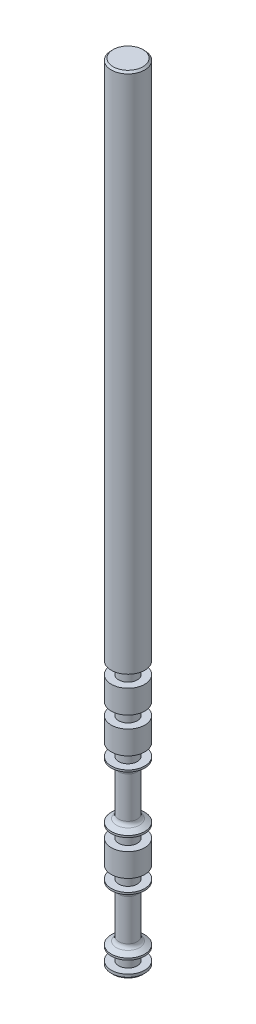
ISO-10303-21;
HEADER;
FILE_DESCRIPTION(('STEP AP214'),'2;1');
FILE_NAME('part.step','',(''),(''),'','','');
FILE_SCHEMA(('AUTOMOTIVE_DESIGN { 1 0 10303 214 1 1 1 1 }'));
ENDSEC;
DATA;
#1=APPLICATION_CONTEXT('core data for automotive mechanical design processes');
#2=APPLICATION_PROTOCOL_DEFINITION('international standard','automotive_design',2000,#1);
#3=PRODUCT_CONTEXT('',#1,'mechanical');
#4=PRODUCT('Part','Part','',(#3));
#5=PRODUCT_RELATED_PRODUCT_CATEGORY('part','',(#4));
#6=PRODUCT_DEFINITION_FORMATION('','',#4);
#7=PRODUCT_DEFINITION_CONTEXT('part definition',#1,'design');
#8=PRODUCT_DEFINITION('design','',#6,#7);
#9=PRODUCT_DEFINITION_SHAPE('','',#8);
#10=(LENGTH_UNIT() NAMED_UNIT(*) SI_UNIT(.MILLI.,.METRE.));
#11=(NAMED_UNIT(*) PLANE_ANGLE_UNIT() SI_UNIT($,.RADIAN.));
#12=(NAMED_UNIT(*) SI_UNIT($,.STERADIAN.) SOLID_ANGLE_UNIT());
#13=UNCERTAINTY_MEASURE_WITH_UNIT(LENGTH_MEASURE(1.E-05),#10,'distance_accuracy_value','');
#14=(GEOMETRIC_REPRESENTATION_CONTEXT(3) GLOBAL_UNCERTAINTY_ASSIGNED_CONTEXT((#13)) GLOBAL_UNIT_ASSIGNED_CONTEXT((#10,
#11,#12)) REPRESENTATION_CONTEXT('',''));
#15=CARTESIAN_POINT('',(0.,0.,0.));
#16=DIRECTION('',(0.,0.,1.));
#17=DIRECTION('',(1.,0.,0.));
#18=AXIS2_PLACEMENT_3D('',#15,#16,#17);
#19=CARTESIAN_POINT('',(56.,-1065.45754338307,0.5));
#20=DIRECTION('',(0.,-1.,0.));
#21=DIRECTION('',(0.,0.,-1.));
#22=AXIS2_PLACEMENT_3D('',#19,#20,#21);
#23=CYLINDRICAL_SURFACE('',#22,1.80000000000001);
#24=CARTESIAN_POINT('',(56.,-2.59999999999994,0.5));
#25=DIRECTION('',(0.,1.,0.));
#26=DIRECTION('',(0.,0.,1.));
#27=AXIS2_PLACEMENT_3D('',#24,#25,#26);
#28=CIRCLE('',#27,1.80000000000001);
#29=CARTESIAN_POINT('',(56.,-2.59999999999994,-1.30000000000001));
#30=VERTEX_POINT('',#29);
#31=EDGE_CURVE('E66',#30,#30,#28,.F.);
#32=ORIENTED_EDGE('',*,*,#31,.T.);
#33=EDGE_LOOP('',(#32));
#34=FACE_BOUND('',#33,.T.);
#35=CARTESIAN_POINT('',(56.,-58.4500000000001,0.5));
#36=DIRECTION('',(0.,-1.,0.));
#37=DIRECTION('',(0.,0.,-1.));
#38=AXIS2_PLACEMENT_3D('',#35,#36,#37);
#39=CIRCLE('',#38,1.80000000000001);
#40=CARTESIAN_POINT('',(56.,-58.4500000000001,-1.30000000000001));
#41=VERTEX_POINT('',#40);
#42=EDGE_CURVE('E156',#41,#41,#39,.T.);
#43=ORIENTED_EDGE('',*,*,#42,.F.);
#44=EDGE_LOOP('',(#43));
#45=FACE_BOUND('',#44,.T.);
#46=ADVANCED_FACE('F31',(#34,#45),#23,.T.);
#47=CARTESIAN_POINT('',(56.,-2.4,0.5));
#48=DIRECTION('',(0.,1.,0.));
#49=DIRECTION('',(0.,0.,1.));
#50=AXIS2_PLACEMENT_3D('',#47,#48,#49);
#51=PLANE('',#50);
#52=CARTESIAN_POINT('',(56.,-2.4,0.5));
#53=DIRECTION('',(0.,1.,0.));
#54=DIRECTION('',(0.,0.,1.));
#55=AXIS2_PLACEMENT_3D('',#52,#53,#54);
#56=CIRCLE('',#55,1.6000000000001);
#57=CARTESIAN_POINT('',(56.,-2.4,-1.1000000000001));
#58=VERTEX_POINT('',#57);
#59=EDGE_CURVE('E63',#58,#58,#56,.T.);
#60=ORIENTED_EDGE('',*,*,#59,.T.);
#61=EDGE_LOOP('',(#60));
#62=FACE_BOUND('',#61,.T.);
#63=ADVANCED_FACE('F164',(#62),#51,.T.);
#64=CARTESIAN_POINT('',(57.8,-86.85,0.5));
#65=DIRECTION('',(0.,-1.,0.));
#66=DIRECTION('',(0.,0.,-1.));
#67=AXIS2_PLACEMENT_3D('',#64,#65,#66);
#68=PLANE('',#67);
#69=CARTESIAN_POINT('',(56.,-86.85,0.5));
#70=DIRECTION('',(0.,-1.,0.));
#71=DIRECTION('',(0.,0.,-1.));
#72=AXIS2_PLACEMENT_3D('',#69,#70,#71);
#73=CIRCLE('',#72,1.60000000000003);
#74=CARTESIAN_POINT('',(56.,-86.85,2.10000000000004));
#75=VERTEX_POINT('',#74);
#76=EDGE_CURVE('E72',#75,#75,#73,.T.);
#77=ORIENTED_EDGE('',*,*,#76,.T.);
#78=EDGE_LOOP('',(#77));
#79=FACE_BOUND('',#78,.T.);
#80=ADVANCED_FACE('F170',(#79),#68,.T.);
#81=CARTESIAN_POINT('',(56.,-1065.45754338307,0.5));
#82=DIRECTION('',(0.,-1.,0.));
#83=DIRECTION('',(0.,0.,-1.));
#84=AXIS2_PLACEMENT_3D('',#81,#82,#83);
#85=CYLINDRICAL_SURFACE('',#84,1.80000000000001);
#86=CARTESIAN_POINT('',(56.,-86.65,0.5));
#87=DIRECTION('',(0.,-1.,0.));
#88=DIRECTION('',(0.,0.,-1.));
#89=AXIS2_PLACEMENT_3D('',#86,#87,#88);
#90=CIRCLE('',#89,1.80000000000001);
#91=CARTESIAN_POINT('',(56.,-86.65,2.30000000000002));
#92=VERTEX_POINT('',#91);
#93=EDGE_CURVE('E69',#92,#92,#90,.F.);
#94=ORIENTED_EDGE('',*,*,#93,.T.);
#95=EDGE_LOOP('',(#94));
#96=FACE_BOUND('',#95,.T.);
#97=CARTESIAN_POINT('',(56.,-86.35,0.5));
#98=DIRECTION('',(0.,-1.,0.));
#99=DIRECTION('',(0.,0.,-1.));
#100=AXIS2_PLACEMENT_3D('',#97,#98,#99);
#101=CIRCLE('',#100,1.80000000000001);
#102=CARTESIAN_POINT('',(56.,-86.35,-1.30000000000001));
#103=VERTEX_POINT('',#102);
#104=EDGE_CURVE('E75',#103,#103,#101,.T.);
#105=ORIENTED_EDGE('',*,*,#104,.T.);
#106=EDGE_LOOP('',(#105));
#107=FACE_BOUND('',#106,.T.);
#108=ADVANCED_FACE('F291',(#96,#107),#85,.T.);
#109=CARTESIAN_POINT('',(57.,-86.35,0.5));
#110=DIRECTION('',(0.,1.,0.));
#111=DIRECTION('',(0.,0.,1.));
#112=AXIS2_PLACEMENT_3D('',#109,#110,#111);
#113=PLANE('',#112);
#114=CARTESIAN_POINT('',(56.,-86.35,0.5));
#115=DIRECTION('',(0.,-1.,0.));
#116=DIRECTION('',(0.,0.,-1.));
#117=AXIS2_PLACEMENT_3D('',#114,#115,#116);
#118=CIRCLE('',#117,1.);
#119=CARTESIAN_POINT('',(56.,-86.35,-0.500000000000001));
#120=VERTEX_POINT('',#119);
#121=EDGE_CURVE('E78',#120,#120,#118,.T.);
#122=ORIENTED_EDGE('',*,*,#121,.T.);
#123=EDGE_LOOP('',(#122));
#124=FACE_BOUND('',#123,.T.);
#125=ORIENTED_EDGE('',*,*,#104,.F.);
#126=EDGE_LOOP('',(#125));
#127=FACE_BOUND('',#126,.T.);
#128=ADVANCED_FACE('F287',(#124,#127),#113,.T.);
#129=CARTESIAN_POINT('',(56.,-1065.45754338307,0.5));
#130=DIRECTION('',(0.,-1.,0.));
#131=DIRECTION('',(0.,0.,-1.));
#132=AXIS2_PLACEMENT_3D('',#129,#130,#131);
#133=CYLINDRICAL_SURFACE('',#132,1.);
#134=CARTESIAN_POINT('',(56.,-85.0500000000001,0.5));
#135=DIRECTION('',(0.,-1.,0.));
#136=DIRECTION('',(0.,0.,-1.));
#137=AXIS2_PLACEMENT_3D('',#134,#135,#136);
#138=CIRCLE('',#137,1.);
#139=CARTESIAN_POINT('',(56.,-85.0500000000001,-0.500000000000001));
#140=VERTEX_POINT('',#139);
#141=EDGE_CURVE('E81',#140,#140,#138,.T.);
#142=ORIENTED_EDGE('',*,*,#141,.T.);
#143=EDGE_LOOP('',(#142));
#144=FACE_BOUND('',#143,.T.);
#145=ORIENTED_EDGE('',*,*,#121,.F.);
#146=EDGE_LOOP('',(#145));
#147=FACE_BOUND('',#146,.T.);
#148=ADVANCED_FACE('F283',(#144,#147),#133,.T.);
#149=CARTESIAN_POINT('',(57.8,-85.05,0.5));
#150=DIRECTION('',(0.,-1.,0.));
#151=DIRECTION('',(0.,0.,-1.));
#152=AXIS2_PLACEMENT_3D('',#149,#150,#151);
#153=PLANE('',#152);
#154=CARTESIAN_POINT('',(56.,-85.0500000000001,0.5));
#155=DIRECTION('',(0.,-1.,0.));
#156=DIRECTION('',(0.,0.,-1.));
#157=AXIS2_PLACEMENT_3D('',#154,#155,#156);
#158=CIRCLE('',#157,1.80000000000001);
#159=CARTESIAN_POINT('',(56.,-85.0500000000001,-1.30000000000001));
#160=VERTEX_POINT('',#159);
#161=EDGE_CURVE('E84',#160,#160,#158,.T.);
#162=ORIENTED_EDGE('',*,*,#161,.T.);
#163=EDGE_LOOP('',(#162));
#164=FACE_BOUND('',#163,.T.);
#165=ORIENTED_EDGE('',*,*,#141,.F.);
#166=EDGE_LOOP('',(#165));
#167=FACE_BOUND('',#166,.T.);
#168=ADVANCED_FACE('F279',(#164,#167),#153,.T.);
#169=CARTESIAN_POINT('',(56.,-1065.45754338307,0.5));
#170=DIRECTION('',(0.,-1.,0.));
#171=DIRECTION('',(0.,0.,-1.));
#172=AXIS2_PLACEMENT_3D('',#169,#170,#171);
#173=CYLINDRICAL_SURFACE('',#172,1.80000000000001);
#174=CARTESIAN_POINT('',(56.,-84.85,0.5));
#175=DIRECTION('',(0.,-1.,0.));
#176=DIRECTION('',(0.,0.,-1.));
#177=AXIS2_PLACEMENT_3D('',#174,#175,#176);
#178=CIRCLE('',#177,1.80000000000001);
#179=CARTESIAN_POINT('',(56.,-84.85,-1.30000000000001));
#180=VERTEX_POINT('',#179);
#181=EDGE_CURVE('E87',#180,#180,#178,.T.);
#182=ORIENTED_EDGE('',*,*,#181,.T.);
#183=EDGE_LOOP('',(#182));
#184=FACE_BOUND('',#183,.T.);
#185=ORIENTED_EDGE('',*,*,#161,.F.);
#186=EDGE_LOOP('',(#185));
#187=FACE_BOUND('',#186,.T.);
#188=ADVANCED_FACE('F275',(#184,#187),#173,.T.);
#189=CARTESIAN_POINT('',(56.,-84.85,0.5));
#190=DIRECTION('',(0.,-1.,0.));
#191=DIRECTION('',(0.,0.,-1.));
#192=AXIS2_PLACEMENT_3D('',#189,#190,#191);
#193=CONICAL_SURFACE('',#192,1.80000000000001,1.04719755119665);
#194=CARTESIAN_POINT('',(56.,-84.5324573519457,0.5));
#195=DIRECTION('',(0.,-1.,0.));
#196=DIRECTION('',(0.,0.,-1.));
#197=AXIS2_PLACEMENT_3D('',#194,#195,#196);
#198=CIRCLE('',#197,1.25000000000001);
#199=CARTESIAN_POINT('',(56.,-84.5324573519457,-0.750000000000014));
#200=VERTEX_POINT('',#199);
#201=EDGE_CURVE('E60',#200,#200,#198,.T.);
#202=ORIENTED_EDGE('',*,*,#201,.T.);
#203=EDGE_LOOP('',(#202));
#204=FACE_BOUND('',#203,.T.);
#205=ORIENTED_EDGE('',*,*,#181,.F.);
#206=EDGE_LOOP('',(#205));
#207=FACE_BOUND('',#206,.T.);
#208=ADVANCED_FACE('F269',(#204,#207),#193,.T.);
#209=CARTESIAN_POINT('',(56.,-1065.45754338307,0.5));
#210=DIRECTION('',(0.,-1.,0.));
#211=DIRECTION('',(0.,0.,-1.));
#212=AXIS2_PLACEMENT_3D('',#209,#210,#211);
#213=CYLINDRICAL_SURFACE('',#212,1.);
#214=CARTESIAN_POINT('',(56.,-84.0994446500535,0.5));
#215=DIRECTION('',(0.,-1.,0.));
#216=DIRECTION('',(0.,0.,-1.));
#217=AXIS2_PLACEMENT_3D('',#214,#215,#216);
#218=CIRCLE('',#217,1.);
#219=CARTESIAN_POINT('',(56.,-84.0994446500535,-0.500000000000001));
#220=VERTEX_POINT('',#219);
#221=EDGE_CURVE('E54',#220,#220,#218,.F.);
#222=ORIENTED_EDGE('',*,*,#221,.T.);
#223=EDGE_LOOP('',(#222));
#224=FACE_BOUND('',#223,.T.);
#225=CARTESIAN_POINT('',(56.,-79.7005553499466,0.5));
#226=DIRECTION('',(0.,-1.,0.));
#227=DIRECTION('',(0.,0.,-1.));
#228=AXIS2_PLACEMENT_3D('',#225,#226,#227);
#229=CIRCLE('',#228,1.);
#230=CARTESIAN_POINT('',(56.,-79.7005553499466,-0.500000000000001));
#231=VERTEX_POINT('',#230);
#232=EDGE_CURVE('E57',#231,#231,#229,.T.);
#233=ORIENTED_EDGE('',*,*,#232,.T.);
#234=EDGE_LOOP('',(#233));
#235=FACE_BOUND('',#234,.T.);
#236=ADVANCED_FACE('F263',(#224,#235),#213,.T.);
#237=CARTESIAN_POINT('',(56.,-79.4118802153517,0.5));
#238=DIRECTION('',(0.,1.,0.));
#239=DIRECTION('',(0.,0.,1.));
#240=AXIS2_PLACEMENT_3D('',#237,#238,#239);
#241=CONICAL_SURFACE('',#240,1.,1.04719755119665);
#242=CARTESIAN_POINT('',(56.,-79.2675426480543,0.5));
#243=DIRECTION('',(0.,1.,0.));
#244=DIRECTION('',(0.,0.,1.));
#245=AXIS2_PLACEMENT_3D('',#242,#243,#244);
#246=CIRCLE('',#245,1.25000000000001);
#247=CARTESIAN_POINT('',(56.,-79.2675426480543,1.75000000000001));
#248=VERTEX_POINT('',#247);
#249=EDGE_CURVE('E51',#248,#248,#246,.T.);
#250=ORIENTED_EDGE('',*,*,#249,.T.);
#251=EDGE_LOOP('',(#250));
#252=FACE_BOUND('',#251,.T.);
#253=CARTESIAN_POINT('',(56.,-78.9500000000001,0.5));
#254=DIRECTION('',(0.,-1.,0.));
#255=DIRECTION('',(0.,0.,-1.));
#256=AXIS2_PLACEMENT_3D('',#253,#254,#255);
#257=CIRCLE('',#256,1.80000000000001);
#258=CARTESIAN_POINT('',(56.,-78.9500000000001,-1.30000000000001));
#259=VERTEX_POINT('',#258);
#260=EDGE_CURVE('E90',#259,#259,#257,.T.);
#261=ORIENTED_EDGE('',*,*,#260,.T.);
#262=EDGE_LOOP('',(#261));
#263=FACE_BOUND('',#262,.T.);
#264=ADVANCED_FACE('F258',(#252,#263),#241,.T.);
#265=CARTESIAN_POINT('',(56.,-1065.45754338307,0.5));
#266=DIRECTION('',(0.,-1.,0.));
#267=DIRECTION('',(0.,0.,-1.));
#268=AXIS2_PLACEMENT_3D('',#265,#266,#267);
#269=CYLINDRICAL_SURFACE('',#268,1.80000000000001);
#270=CARTESIAN_POINT('',(56.,-78.75,0.5));
#271=DIRECTION('',(0.,-1.,0.));
#272=DIRECTION('',(0.,0.,-1.));
#273=AXIS2_PLACEMENT_3D('',#270,#271,#272);
#274=CIRCLE('',#273,1.80000000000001);
#275=CARTESIAN_POINT('',(56.,-78.75,-1.30000000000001));
#276=VERTEX_POINT('',#275);
#277=EDGE_CURVE('E93',#276,#276,#274,.T.);
#278=ORIENTED_EDGE('',*,*,#277,.T.);
#279=EDGE_LOOP('',(#278));
#280=FACE_BOUND('',#279,.T.);
#281=ORIENTED_EDGE('',*,*,#260,.F.);
#282=EDGE_LOOP('',(#281));
#283=FACE_BOUND('',#282,.T.);
#284=ADVANCED_FACE('F252',(#280,#283),#269,.T.);
#285=CARTESIAN_POINT('',(57.,-78.75,0.5));
#286=DIRECTION('',(0.,1.,0.));
#287=DIRECTION('',(0.,0.,1.));
#288=AXIS2_PLACEMENT_3D('',#285,#286,#287);
#289=PLANE('',#288);
#290=CARTESIAN_POINT('',(56.,-78.75,0.5));
#291=DIRECTION('',(0.,-1.,0.));
#292=DIRECTION('',(0.,0.,-1.));
#293=AXIS2_PLACEMENT_3D('',#290,#291,#292);
#294=CIRCLE('',#293,1.);
#295=CARTESIAN_POINT('',(56.,-78.75,-0.500000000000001));
#296=VERTEX_POINT('',#295);
#297=EDGE_CURVE('E96',#296,#296,#294,.T.);
#298=ORIENTED_EDGE('',*,*,#297,.T.);
#299=EDGE_LOOP('',(#298));
#300=FACE_BOUND('',#299,.T.);
#301=ORIENTED_EDGE('',*,*,#277,.F.);
#302=EDGE_LOOP('',(#301));
#303=FACE_BOUND('',#302,.T.);
#304=ADVANCED_FACE('F246',(#300,#303),#289,.T.);
#305=CARTESIAN_POINT('',(56.,-1065.45754338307,0.5));
#306=DIRECTION('',(0.,-1.,0.));
#307=DIRECTION('',(0.,0.,-1.));
#308=AXIS2_PLACEMENT_3D('',#305,#306,#307);
#309=CYLINDRICAL_SURFACE('',#308,1.);
#310=CARTESIAN_POINT('',(56.,-77.45,0.5));
#311=DIRECTION('',(0.,-1.,0.));
#312=DIRECTION('',(0.,0.,-1.));
#313=AXIS2_PLACEMENT_3D('',#310,#311,#312);
#314=CIRCLE('',#313,1.);
#315=CARTESIAN_POINT('',(56.,-77.45,-0.500000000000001));
#316=VERTEX_POINT('',#315);
#317=EDGE_CURVE('E99',#316,#316,#314,.T.);
#318=ORIENTED_EDGE('',*,*,#317,.T.);
#319=EDGE_LOOP('',(#318));
#320=FACE_BOUND('',#319,.T.);
#321=ORIENTED_EDGE('',*,*,#297,.F.);
#322=EDGE_LOOP('',(#321));
#323=FACE_BOUND('',#322,.T.);
#324=ADVANCED_FACE('F240',(#320,#323),#309,.T.);
#325=CARTESIAN_POINT('',(57.8,-77.45,0.5));
#326=DIRECTION('',(0.,-1.,0.));
#327=DIRECTION('',(0.,0.,-1.));
#328=AXIS2_PLACEMENT_3D('',#325,#326,#327);
#329=PLANE('',#328);
#330=CARTESIAN_POINT('',(56.,-77.45,0.5));
#331=DIRECTION('',(0.,-1.,0.));
#332=DIRECTION('',(0.,0.,-1.));
#333=AXIS2_PLACEMENT_3D('',#330,#331,#332);
#334=CIRCLE('',#333,1.80000000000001);
#335=CARTESIAN_POINT('',(56.,-77.45,-1.30000000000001));
#336=VERTEX_POINT('',#335);
#337=EDGE_CURVE('E102',#336,#336,#334,.T.);
#338=ORIENTED_EDGE('',*,*,#337,.T.);
#339=EDGE_LOOP('',(#338));
#340=FACE_BOUND('',#339,.T.);
#341=ORIENTED_EDGE('',*,*,#317,.F.);
#342=EDGE_LOOP('',(#341));
#343=FACE_BOUND('',#342,.T.);
#344=ADVANCED_FACE('F234',(#340,#343),#329,.T.);
#345=CARTESIAN_POINT('',(56.,-1065.45754338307,0.5));
#346=DIRECTION('',(0.,-1.,0.));
#347=DIRECTION('',(0.,0.,-1.));
#348=AXIS2_PLACEMENT_3D('',#345,#346,#347);
#349=CYLINDRICAL_SURFACE('',#348,1.80000000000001);
#350=CARTESIAN_POINT('',(56.,-74.9500000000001,0.5));
#351=DIRECTION('',(0.,-1.,0.));
#352=DIRECTION('',(0.,0.,-1.));
#353=AXIS2_PLACEMENT_3D('',#350,#351,#352);
#354=CIRCLE('',#353,1.80000000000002);
#355=CARTESIAN_POINT('',(56.,-74.9500000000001,-1.30000000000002));
#356=VERTEX_POINT('',#355);
#357=EDGE_CURVE('E105',#356,#356,#354,.T.);
#358=ORIENTED_EDGE('',*,*,#357,.T.);
#359=EDGE_LOOP('',(#358));
#360=FACE_BOUND('',#359,.T.);
#361=ORIENTED_EDGE('',*,*,#337,.F.);
#362=EDGE_LOOP('',(#361));
#363=FACE_BOUND('',#362,.T.);
#364=ADVANCED_FACE('F228',(#360,#363),#349,.T.);
#365=CARTESIAN_POINT('',(57.,-74.95,0.5));
#366=DIRECTION('',(0.,1.,0.));
#367=DIRECTION('',(0.,0.,1.));
#368=AXIS2_PLACEMENT_3D('',#365,#366,#367);
#369=PLANE('',#368);
#370=CARTESIAN_POINT('',(56.,-74.95,0.5));
#371=DIRECTION('',(0.,-1.,0.));
#372=DIRECTION('',(0.,0.,-1.));
#373=AXIS2_PLACEMENT_3D('',#370,#371,#372);
#374=CIRCLE('',#373,1.);
#375=CARTESIAN_POINT('',(56.,-74.95,-0.500000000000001));
#376=VERTEX_POINT('',#375);
#377=EDGE_CURVE('E108',#376,#376,#374,.T.);
#378=ORIENTED_EDGE('',*,*,#377,.T.);
#379=EDGE_LOOP('',(#378));
#380=FACE_BOUND('',#379,.T.);
#381=ORIENTED_EDGE('',*,*,#357,.F.);
#382=EDGE_LOOP('',(#381));
#383=FACE_BOUND('',#382,.T.);
#384=ADVANCED_FACE('F222',(#380,#383),#369,.T.);
#385=CARTESIAN_POINT('',(56.,-1065.45754338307,0.5));
#386=DIRECTION('',(0.,-1.,0.));
#387=DIRECTION('',(0.,0.,-1.));
#388=AXIS2_PLACEMENT_3D('',#385,#386,#387);
#389=CYLINDRICAL_SURFACE('',#388,1.);
#390=CARTESIAN_POINT('',(56.,-73.65,0.5));
#391=DIRECTION('',(0.,-1.,0.));
#392=DIRECTION('',(0.,0.,-1.));
#393=AXIS2_PLACEMENT_3D('',#390,#391,#392);
#394=CIRCLE('',#393,1.);
#395=CARTESIAN_POINT('',(56.,-73.65,-0.500000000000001));
#396=VERTEX_POINT('',#395);
#397=EDGE_CURVE('E111',#396,#396,#394,.T.);
#398=ORIENTED_EDGE('',*,*,#397,.T.);
#399=EDGE_LOOP('',(#398));
#400=FACE_BOUND('',#399,.T.);
#401=ORIENTED_EDGE('',*,*,#377,.F.);
#402=EDGE_LOOP('',(#401));
#403=FACE_BOUND('',#402,.T.);
#404=ADVANCED_FACE('F216',(#400,#403),#389,.T.);
#405=CARTESIAN_POINT('',(57.8,-73.65,0.5));
#406=DIRECTION('',(0.,-1.,0.));
#407=DIRECTION('',(0.,0.,-1.));
#408=AXIS2_PLACEMENT_3D('',#405,#406,#407);
#409=PLANE('',#408);
#410=CARTESIAN_POINT('',(56.,-73.65,0.5));
#411=DIRECTION('',(0.,-1.,0.));
#412=DIRECTION('',(0.,0.,-1.));
#413=AXIS2_PLACEMENT_3D('',#410,#411,#412);
#414=CIRCLE('',#413,1.80000000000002);
#415=CARTESIAN_POINT('',(56.,-73.65,-1.30000000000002));
#416=VERTEX_POINT('',#415);
#417=EDGE_CURVE('E114',#416,#416,#414,.T.);
#418=ORIENTED_EDGE('',*,*,#417,.T.);
#419=EDGE_LOOP('',(#418));
#420=FACE_BOUND('',#419,.T.);
#421=ORIENTED_EDGE('',*,*,#397,.F.);
#422=EDGE_LOOP('',(#421));
#423=FACE_BOUND('',#422,.T.);
#424=ADVANCED_FACE('F210',(#420,#423),#409,.T.);
#425=CARTESIAN_POINT('',(56.,-1065.45754338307,0.5));
#426=DIRECTION('',(0.,-1.,0.));
#427=DIRECTION('',(0.,0.,-1.));
#428=AXIS2_PLACEMENT_3D('',#425,#426,#427);
#429=CYLINDRICAL_SURFACE('',#428,1.80000000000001);
#430=CARTESIAN_POINT('',(56.,-73.45,0.5));
#431=DIRECTION('',(0.,-1.,0.));
#432=DIRECTION('',(0.,0.,-1.));
#433=AXIS2_PLACEMENT_3D('',#430,#431,#432);
#434=CIRCLE('',#433,1.80000000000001);
#435=CARTESIAN_POINT('',(56.,-73.45,-1.30000000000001));
#436=VERTEX_POINT('',#435);
#437=EDGE_CURVE('E117',#436,#436,#434,.T.);
#438=ORIENTED_EDGE('',*,*,#437,.T.);
#439=EDGE_LOOP('',(#438));
#440=FACE_BOUND('',#439,.T.);
#441=ORIENTED_EDGE('',*,*,#417,.F.);
#442=EDGE_LOOP('',(#441));
#443=FACE_BOUND('',#442,.T.);
#444=ADVANCED_FACE('F204',(#440,#443),#429,.T.);
#445=CARTESIAN_POINT('',(56.,-73.45,0.5));
#446=DIRECTION('',(0.,-1.,0.));
#447=DIRECTION('',(0.,0.,-1.));
#448=AXIS2_PLACEMENT_3D('',#445,#446,#447);
#449=CONICAL_SURFACE('',#448,1.80000000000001,1.04719755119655);
#450=CARTESIAN_POINT('',(56.,-73.1324573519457,0.5));
#451=DIRECTION('',(0.,-1.,0.));
#452=DIRECTION('',(0.,0.,-1.));
#453=AXIS2_PLACEMENT_3D('',#450,#451,#452);
#454=CIRCLE('',#453,1.25);
#455=CARTESIAN_POINT('',(56.,-73.1324573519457,-0.750000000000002));
#456=VERTEX_POINT('',#455);
#457=EDGE_CURVE('E46',#456,#456,#454,.T.);
#458=ORIENTED_EDGE('',*,*,#457,.T.);
#459=EDGE_LOOP('',(#458));
#460=FACE_BOUND('',#459,.T.);
#461=ORIENTED_EDGE('',*,*,#437,.F.);
#462=EDGE_LOOP('',(#461));
#463=FACE_BOUND('',#462,.T.);
#464=ADVANCED_FACE('F200',(#460,#463),#449,.T.);
#465=CARTESIAN_POINT('',(56.,-1065.45754338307,0.5));
#466=DIRECTION('',(0.,-1.,0.));
#467=DIRECTION('',(0.,0.,-1.));
#468=AXIS2_PLACEMENT_3D('',#465,#466,#467);
#469=CYLINDRICAL_SURFACE('',#468,1.);
#470=CARTESIAN_POINT('',(56.,-72.6994446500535,0.5));
#471=DIRECTION('',(0.,-1.,0.));
#472=DIRECTION('',(0.,0.,-1.));
#473=AXIS2_PLACEMENT_3D('',#470,#471,#472);
#474=CIRCLE('',#473,1.);
#475=CARTESIAN_POINT('',(56.,-72.6994446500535,-0.500000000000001));
#476=VERTEX_POINT('',#475);
#477=EDGE_CURVE('E38',#476,#476,#474,.F.);
#478=ORIENTED_EDGE('',*,*,#477,.T.);
#479=EDGE_LOOP('',(#478));
#480=FACE_BOUND('',#479,.T.);
#481=CARTESIAN_POINT('',(56.,-68.3005553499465,0.5));
#482=DIRECTION('',(0.,-1.,0.));
#483=DIRECTION('',(0.,0.,-1.));
#484=AXIS2_PLACEMENT_3D('',#481,#482,#483);
#485=CIRCLE('',#484,1.);
#486=CARTESIAN_POINT('',(56.,-68.3005553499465,-0.500000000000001));
#487=VERTEX_POINT('',#486);
#488=EDGE_CURVE('E42',#487,#487,#485,.T.);
#489=ORIENTED_EDGE('',*,*,#488,.T.);
#490=EDGE_LOOP('',(#489));
#491=FACE_BOUND('',#490,.T.);
#492=ADVANCED_FACE('F203',(#480,#491),#469,.T.);
#493=CARTESIAN_POINT('',(56.,-68.0118802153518,0.5));
#494=DIRECTION('',(0.,1.,0.));
#495=DIRECTION('',(0.,0.,1.));
#496=AXIS2_PLACEMENT_3D('',#493,#494,#495);
#497=CONICAL_SURFACE('',#496,1.,1.04719755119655);
#498=CARTESIAN_POINT('',(56.,-67.8675426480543,0.5));
#499=DIRECTION('',(0.,1.,0.));
#500=DIRECTION('',(0.,0.,1.));
#501=AXIS2_PLACEMENT_3D('',#498,#499,#500);
#502=CIRCLE('',#501,1.25);
#503=CARTESIAN_POINT('',(56.,-67.8675426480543,1.75));
#504=VERTEX_POINT('',#503);
#505=EDGE_CURVE('E10',#504,#504,#502,.T.);
#506=ORIENTED_EDGE('',*,*,#505,.T.);
#507=EDGE_LOOP('',(#506));
#508=FACE_BOUND('',#507,.T.);
#509=CARTESIAN_POINT('',(56.,-67.55,0.5));
#510=DIRECTION('',(0.,-1.,0.));
#511=DIRECTION('',(0.,0.,-1.));
#512=AXIS2_PLACEMENT_3D('',#509,#510,#511);
#513=CIRCLE('',#512,1.80000000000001);
#514=CARTESIAN_POINT('',(56.,-67.55,-1.30000000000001));
#515=VERTEX_POINT('',#514);
#516=EDGE_CURVE('E120',#515,#515,#513,.T.);
#517=ORIENTED_EDGE('',*,*,#516,.T.);
#518=EDGE_LOOP('',(#517));
#519=FACE_BOUND('',#518,.T.);
#520=ADVANCED_FACE('F355',(#508,#519),#497,.T.);
#521=CARTESIAN_POINT('',(56.,-1065.45754338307,0.5));
#522=DIRECTION('',(0.,-1.,0.));
#523=DIRECTION('',(0.,0.,-1.));
#524=AXIS2_PLACEMENT_3D('',#521,#522,#523);
#525=CYLINDRICAL_SURFACE('',#524,1.80000000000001);
#526=CARTESIAN_POINT('',(56.,-67.35,0.5));
#527=DIRECTION('',(0.,-1.,0.));
#528=DIRECTION('',(0.,0.,-1.));
#529=AXIS2_PLACEMENT_3D('',#526,#527,#528);
#530=CIRCLE('',#529,1.80000000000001);
#531=CARTESIAN_POINT('',(56.,-67.35,-1.30000000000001));
#532=VERTEX_POINT('',#531);
#533=EDGE_CURVE('E123',#532,#532,#530,.T.);
#534=ORIENTED_EDGE('',*,*,#533,.T.);
#535=EDGE_LOOP('',(#534));
#536=FACE_BOUND('',#535,.T.);
#537=ORIENTED_EDGE('',*,*,#516,.F.);
#538=EDGE_LOOP('',(#537));
#539=FACE_BOUND('',#538,.T.);
#540=ADVANCED_FACE('F364',(#536,#539),#525,.T.);
#541=CARTESIAN_POINT('',(57.,-67.35,0.5));
#542=DIRECTION('',(0.,1.,0.));
#543=DIRECTION('',(0.,0.,1.));
#544=AXIS2_PLACEMENT_3D('',#541,#542,#543);
#545=PLANE('',#544);
#546=CARTESIAN_POINT('',(56.,-67.35,0.5));
#547=DIRECTION('',(0.,-1.,0.));
#548=DIRECTION('',(0.,0.,-1.));
#549=AXIS2_PLACEMENT_3D('',#546,#547,#548);
#550=CIRCLE('',#549,1.);
#551=CARTESIAN_POINT('',(56.,-67.35,-0.500000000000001));
#552=VERTEX_POINT('',#551);
#553=EDGE_CURVE('E126',#552,#552,#550,.T.);
#554=ORIENTED_EDGE('',*,*,#553,.T.);
#555=EDGE_LOOP('',(#554));
#556=FACE_BOUND('',#555,.T.);
#557=ORIENTED_EDGE('',*,*,#533,.F.);
#558=EDGE_LOOP('',(#557));
#559=FACE_BOUND('',#558,.T.);
#560=ADVANCED_FACE('F473',(#556,#559),#545,.T.);
#561=CARTESIAN_POINT('',(56.,-1065.45754338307,0.5));
#562=DIRECTION('',(0.,-1.,0.));
#563=DIRECTION('',(0.,0.,-1.));
#564=AXIS2_PLACEMENT_3D('',#561,#562,#563);
#565=CYLINDRICAL_SURFACE('',#564,1.);
#566=CARTESIAN_POINT('',(56.,-66.0500000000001,0.5));
#567=DIRECTION('',(0.,-1.,0.));
#568=DIRECTION('',(0.,0.,-1.));
#569=AXIS2_PLACEMENT_3D('',#566,#567,#568);
#570=CIRCLE('',#569,1.);
#571=CARTESIAN_POINT('',(56.,-66.0500000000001,-0.500000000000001));
#572=VERTEX_POINT('',#571);
#573=EDGE_CURVE('E129',#572,#572,#570,.T.);
#574=ORIENTED_EDGE('',*,*,#573,.T.);
#575=EDGE_LOOP('',(#574));
#576=FACE_BOUND('',#575,.T.);
#577=ORIENTED_EDGE('',*,*,#553,.F.);
#578=EDGE_LOOP('',(#577));
#579=FACE_BOUND('',#578,.T.);
#580=ADVANCED_FACE('F465',(#576,#579),#565,.T.);
#581=CARTESIAN_POINT('',(57.8,-66.05,0.5));
#582=DIRECTION('',(0.,-1.,0.));
#583=DIRECTION('',(0.,0.,-1.));
#584=AXIS2_PLACEMENT_3D('',#581,#582,#583);
#585=PLANE('',#584);
#586=CARTESIAN_POINT('',(56.,-66.0500000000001,0.5));
#587=DIRECTION('',(0.,-1.,0.));
#588=DIRECTION('',(0.,0.,-1.));
#589=AXIS2_PLACEMENT_3D('',#586,#587,#588);
#590=CIRCLE('',#589,1.80000000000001);
#591=CARTESIAN_POINT('',(56.,-66.0500000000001,-1.30000000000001));
#592=VERTEX_POINT('',#591);
#593=EDGE_CURVE('E132',#592,#592,#590,.T.);
#594=ORIENTED_EDGE('',*,*,#593,.T.);
#595=EDGE_LOOP('',(#594));
#596=FACE_BOUND('',#595,.T.);
#597=ORIENTED_EDGE('',*,*,#573,.F.);
#598=EDGE_LOOP('',(#597));
#599=FACE_BOUND('',#598,.T.);
#600=ADVANCED_FACE('F457',(#596,#599),#585,.T.);
#601=CARTESIAN_POINT('',(56.,-1065.45754338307,0.5));
#602=DIRECTION('',(0.,-1.,0.));
#603=DIRECTION('',(0.,0.,-1.));
#604=AXIS2_PLACEMENT_3D('',#601,#602,#603);
#605=CYLINDRICAL_SURFACE('',#604,1.80000000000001);
#606=CARTESIAN_POINT('',(56.,-63.55,0.5));
#607=DIRECTION('',(0.,-1.,0.));
#608=DIRECTION('',(0.,0.,-1.));
#609=AXIS2_PLACEMENT_3D('',#606,#607,#608);
#610=CIRCLE('',#609,1.80000000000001);
#611=CARTESIAN_POINT('',(56.,-63.55,-1.30000000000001));
#612=VERTEX_POINT('',#611);
#613=EDGE_CURVE('E135',#612,#612,#610,.T.);
#614=ORIENTED_EDGE('',*,*,#613,.T.);
#615=EDGE_LOOP('',(#614));
#616=FACE_BOUND('',#615,.T.);
#617=ORIENTED_EDGE('',*,*,#593,.F.);
#618=EDGE_LOOP('',(#617));
#619=FACE_BOUND('',#618,.T.);
#620=ADVANCED_FACE('F449',(#616,#619),#605,.T.);
#621=CARTESIAN_POINT('',(57.8,-63.55,0.5));
#622=DIRECTION('',(0.,1.,0.));
#623=DIRECTION('',(0.,0.,1.));
#624=AXIS2_PLACEMENT_3D('',#621,#622,#623);
#625=PLANE('',#624);
#626=CARTESIAN_POINT('',(56.,-63.55,0.5));
#627=DIRECTION('',(0.,-1.,0.));
#628=DIRECTION('',(0.,0.,-1.));
#629=AXIS2_PLACEMENT_3D('',#626,#627,#628);
#630=CIRCLE('',#629,1.);
#631=CARTESIAN_POINT('',(56.,-63.55,-0.500000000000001));
#632=VERTEX_POINT('',#631);
#633=EDGE_CURVE('E138',#632,#632,#630,.T.);
#634=ORIENTED_EDGE('',*,*,#633,.T.);
#635=EDGE_LOOP('',(#634));
#636=FACE_BOUND('',#635,.T.);
#637=ORIENTED_EDGE('',*,*,#613,.F.);
#638=EDGE_LOOP('',(#637));
#639=FACE_BOUND('',#638,.T.);
#640=ADVANCED_FACE('F441',(#636,#639),#625,.T.);
#641=CARTESIAN_POINT('',(56.,-1065.45754338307,0.5));
#642=DIRECTION('',(0.,-1.,0.));
#643=DIRECTION('',(0.,0.,-1.));
#644=AXIS2_PLACEMENT_3D('',#641,#642,#643);
#645=CYLINDRICAL_SURFACE('',#644,1.);
#646=CARTESIAN_POINT('',(56.,-62.2499999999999,0.5));
#647=DIRECTION('',(0.,-1.,0.));
#648=DIRECTION('',(0.,0.,-1.));
#649=AXIS2_PLACEMENT_3D('',#646,#647,#648);
#650=CIRCLE('',#649,1.);
#651=CARTESIAN_POINT('',(56.,-62.2499999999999,-0.500000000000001));
#652=VERTEX_POINT('',#651);
#653=EDGE_CURVE('E141',#652,#652,#650,.T.);
#654=ORIENTED_EDGE('',*,*,#653,.T.);
#655=EDGE_LOOP('',(#654));
#656=FACE_BOUND('',#655,.T.);
#657=ORIENTED_EDGE('',*,*,#633,.F.);
#658=EDGE_LOOP('',(#657));
#659=FACE_BOUND('',#658,.T.);
#660=ADVANCED_FACE('F433',(#656,#659),#645,.T.);
#661=CARTESIAN_POINT('',(57.,-62.25,0.5));
#662=DIRECTION('',(0.,-1.,0.));
#663=DIRECTION('',(0.,0.,-1.));
#664=AXIS2_PLACEMENT_3D('',#661,#662,#663);
#665=PLANE('',#664);
#666=CARTESIAN_POINT('',(56.,-62.2499999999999,0.5));
#667=DIRECTION('',(0.,-1.,0.));
#668=DIRECTION('',(0.,0.,-1.));
#669=AXIS2_PLACEMENT_3D('',#666,#667,#668);
#670=CIRCLE('',#669,1.80000000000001);
#671=CARTESIAN_POINT('',(56.,-62.2499999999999,-1.30000000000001));
#672=VERTEX_POINT('',#671);
#673=EDGE_CURVE('E144',#672,#672,#670,.T.);
#674=ORIENTED_EDGE('',*,*,#673,.T.);
#675=EDGE_LOOP('',(#674));
#676=FACE_BOUND('',#675,.T.);
#677=ORIENTED_EDGE('',*,*,#653,.F.);
#678=EDGE_LOOP('',(#677));
#679=FACE_BOUND('',#678,.T.);
#680=ADVANCED_FACE('F425',(#676,#679),#665,.T.);
#681=CARTESIAN_POINT('',(56.,-1065.45754338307,0.5));
#682=DIRECTION('',(0.,-1.,0.));
#683=DIRECTION('',(0.,0.,-1.));
#684=AXIS2_PLACEMENT_3D('',#681,#682,#683);
#685=CYLINDRICAL_SURFACE('',#684,1.80000000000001);
#686=CARTESIAN_POINT('',(56.,-59.75,0.5));
#687=DIRECTION('',(0.,-1.,0.));
#688=DIRECTION('',(0.,0.,-1.));
#689=AXIS2_PLACEMENT_3D('',#686,#687,#688);
#690=CIRCLE('',#689,1.80000000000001);
#691=CARTESIAN_POINT('',(56.,-59.75,-1.30000000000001));
#692=VERTEX_POINT('',#691);
#693=EDGE_CURVE('E147',#692,#692,#690,.T.);
#694=ORIENTED_EDGE('',*,*,#693,.T.);
#695=EDGE_LOOP('',(#694));
#696=FACE_BOUND('',#695,.T.);
#697=ORIENTED_EDGE('',*,*,#673,.F.);
#698=EDGE_LOOP('',(#697));
#699=FACE_BOUND('',#698,.T.);
#700=ADVANCED_FACE('F417',(#696,#699),#685,.T.);
#701=CARTESIAN_POINT('',(57.8,-59.75,0.5));
#702=DIRECTION('',(0.,1.,0.));
#703=DIRECTION('',(0.,0.,1.));
#704=AXIS2_PLACEMENT_3D('',#701,#702,#703);
#705=PLANE('',#704);
#706=CARTESIAN_POINT('',(56.,-59.75,0.5));
#707=DIRECTION('',(0.,-1.,0.));
#708=DIRECTION('',(0.,0.,-1.));
#709=AXIS2_PLACEMENT_3D('',#706,#707,#708);
#710=CIRCLE('',#709,1.);
#711=CARTESIAN_POINT('',(56.,-59.75,-0.500000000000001));
#712=VERTEX_POINT('',#711);
#713=EDGE_CURVE('E150',#712,#712,#710,.T.);
#714=ORIENTED_EDGE('',*,*,#713,.T.);
#715=EDGE_LOOP('',(#714));
#716=FACE_BOUND('',#715,.T.);
#717=ORIENTED_EDGE('',*,*,#693,.F.);
#718=EDGE_LOOP('',(#717));
#719=FACE_BOUND('',#718,.T.);
#720=ADVANCED_FACE('F409',(#716,#719),#705,.T.);
#721=CARTESIAN_POINT('',(56.,-1065.45754338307,0.5));
#722=DIRECTION('',(0.,-1.,0.));
#723=DIRECTION('',(0.,0.,-1.));
#724=AXIS2_PLACEMENT_3D('',#721,#722,#723);
#725=CYLINDRICAL_SURFACE('',#724,1.);
#726=CARTESIAN_POINT('',(56.,-58.4500000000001,0.5));
#727=DIRECTION('',(0.,-1.,0.));
#728=DIRECTION('',(0.,0.,-1.));
#729=AXIS2_PLACEMENT_3D('',#726,#727,#728);
#730=CIRCLE('',#729,1.);
#731=CARTESIAN_POINT('',(56.,-58.4500000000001,-0.500000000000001));
#732=VERTEX_POINT('',#731);
#733=EDGE_CURVE('E153',#732,#732,#730,.T.);
#734=ORIENTED_EDGE('',*,*,#733,.T.);
#735=EDGE_LOOP('',(#734));
#736=FACE_BOUND('',#735,.T.);
#737=ORIENTED_EDGE('',*,*,#713,.F.);
#738=EDGE_LOOP('',(#737));
#739=FACE_BOUND('',#738,.T.);
#740=ADVANCED_FACE('F402',(#736,#739),#725,.T.);
#741=CARTESIAN_POINT('',(57.,-58.45,0.5));
#742=DIRECTION('',(0.,-1.,0.));
#743=DIRECTION('',(0.,0.,-1.));
#744=AXIS2_PLACEMENT_3D('',#741,#742,#743);
#745=PLANE('',#744);
#746=ORIENTED_EDGE('',*,*,#42,.T.);
#747=EDGE_LOOP('',(#746));
#748=FACE_BOUND('',#747,.T.);
#749=ORIENTED_EDGE('',*,*,#733,.F.);
#750=EDGE_LOOP('',(#749));
#751=FACE_BOUND('',#750,.T.);
#752=ADVANCED_FACE('F160',(#748,#751),#745,.T.);
#753=CARTESIAN_POINT('',(56.,-86.85,0.5));
#754=DIRECTION('',(0.,1.,0.));
#755=DIRECTION('',(0.,0.,1.));
#756=AXIS2_PLACEMENT_3D('',#753,#754,#755);
#757=CONICAL_SURFACE('',#756,1.60000000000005,0.785398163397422);
#758=CARTESIAN_POINT('',(56.,-86.65,2.30000000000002));
#759=CARTESIAN_POINT('',(56.,-86.6520833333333,2.29791666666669));
#760=CARTESIAN_POINT('',(56.,-86.6541666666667,2.29583333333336));
#761=CARTESIAN_POINT('',(56.,-86.6583333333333,2.29166666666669));
#762=CARTESIAN_POINT('',(56.,-86.6604166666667,2.28958333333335));
#763=CARTESIAN_POINT('',(56.,-86.6645833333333,2.28541666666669));
#764=CARTESIAN_POINT('',(56.,-86.6666666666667,2.28333333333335));
#765=CARTESIAN_POINT('',(56.,-86.6708333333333,2.27916666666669));
#766=CARTESIAN_POINT('',(56.,-86.6729166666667,2.27708333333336));
#767=CARTESIAN_POINT('',(56.,-86.6770833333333,2.27291666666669));
#768=CARTESIAN_POINT('',(56.,-86.6791666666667,2.27083333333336));
#769=CARTESIAN_POINT('',(56.,-86.6833333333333,2.26666666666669));
#770=CARTESIAN_POINT('',(56.,-86.6854166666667,2.26458333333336));
#771=CARTESIAN_POINT('',(56.,-86.6895833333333,2.26041666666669));
#772=CARTESIAN_POINT('',(56.,-86.6916666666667,2.25833333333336));
#773=CARTESIAN_POINT('',(56.,-86.6958333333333,2.25416666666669));
#774=CARTESIAN_POINT('',(56.,-86.6979166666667,2.25208333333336));
#775=CARTESIAN_POINT('',(56.,-86.7020833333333,2.24791666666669));
#776=CARTESIAN_POINT('',(56.,-86.7041666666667,2.24583333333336));
#777=CARTESIAN_POINT('',(56.,-86.7083333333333,2.24166666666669));
#778=CARTESIAN_POINT('',(56.,-86.7104166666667,2.23958333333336));
#779=CARTESIAN_POINT('',(56.,-86.7145833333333,2.23541666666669));
#780=CARTESIAN_POINT('',(56.,-86.7166666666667,2.23333333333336));
#781=CARTESIAN_POINT('',(56.,-86.7208333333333,2.22916666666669));
#782=CARTESIAN_POINT('',(56.,-86.7229166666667,2.22708333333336));
#783=CARTESIAN_POINT('',(56.,-86.7270833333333,2.22291666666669));
#784=CARTESIAN_POINT('',(56.,-86.7291666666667,2.22083333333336));
#785=CARTESIAN_POINT('',(56.,-86.7333333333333,2.21666666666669));
#786=CARTESIAN_POINT('',(56.,-86.7354166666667,2.21458333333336));
#787=CARTESIAN_POINT('',(56.,-86.7395833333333,2.2104166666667));
#788=CARTESIAN_POINT('',(56.,-86.7416666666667,2.20833333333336));
#789=CARTESIAN_POINT('',(56.,-86.7458333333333,2.2041666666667));
#790=CARTESIAN_POINT('',(56.,-86.7479166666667,2.20208333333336));
#791=CARTESIAN_POINT('',(56.,-86.7520833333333,2.1979166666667));
#792=CARTESIAN_POINT('',(56.,-86.7541666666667,2.19583333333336));
#793=CARTESIAN_POINT('',(56.,-86.7583333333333,2.1916666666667));
#794=CARTESIAN_POINT('',(56.,-86.7604166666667,2.18958333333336));
#795=CARTESIAN_POINT('',(56.,-86.7645833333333,2.1854166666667));
#796=CARTESIAN_POINT('',(56.,-86.7666666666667,2.18333333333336));
#797=CARTESIAN_POINT('',(56.,-86.7708333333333,2.1791666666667));
#798=CARTESIAN_POINT('',(56.,-86.7729166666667,2.17708333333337));
#799=CARTESIAN_POINT('',(56.,-86.7770833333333,2.1729166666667));
#800=CARTESIAN_POINT('',(56.,-86.7791666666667,2.17083333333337));
#801=CARTESIAN_POINT('',(56.,-86.7833333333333,2.1666666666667));
#802=CARTESIAN_POINT('',(56.,-86.7854166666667,2.16458333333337));
#803=CARTESIAN_POINT('',(56.,-86.7895833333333,2.1604166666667));
#804=CARTESIAN_POINT('',(56.,-86.7916666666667,2.15833333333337));
#805=CARTESIAN_POINT('',(56.,-86.7958333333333,2.1541666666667));
#806=CARTESIAN_POINT('',(56.,-86.7979166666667,2.15208333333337));
#807=CARTESIAN_POINT('',(56.,-86.8020833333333,2.1479166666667));
#808=CARTESIAN_POINT('',(56.,-86.8041666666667,2.14583333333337));
#809=CARTESIAN_POINT('',(56.,-86.8083333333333,2.1416666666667));
#810=CARTESIAN_POINT('',(56.,-86.8104166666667,2.13958333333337));
#811=CARTESIAN_POINT('',(56.,-86.8145833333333,2.1354166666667));
#812=CARTESIAN_POINT('',(56.,-86.8166666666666,2.13333333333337));
#813=CARTESIAN_POINT('',(56.,-86.8208333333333,2.1291666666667));
#814=CARTESIAN_POINT('',(56.,-86.8229166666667,2.12708333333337));
#815=CARTESIAN_POINT('',(56.,-86.8270833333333,2.1229166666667));
#816=CARTESIAN_POINT('',(56.,-86.8291666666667,2.12083333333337));
#817=CARTESIAN_POINT('',(56.,-86.8333333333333,2.1166666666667));
#818=CARTESIAN_POINT('',(56.,-86.8354166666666,2.11458333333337));
#819=CARTESIAN_POINT('',(56.,-86.8395833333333,2.1104166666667));
#820=CARTESIAN_POINT('',(56.,-86.8416666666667,2.10833333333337));
#821=CARTESIAN_POINT('',(56.,-86.8458333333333,2.10416666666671));
#822=CARTESIAN_POINT('',(56.,-86.8479166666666,2.10208333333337));
#823=CARTESIAN_POINT('',(56.,-86.85,2.10000000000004));
#824=B_SPLINE_CURVE_WITH_KNOTS('',3,(#758,#759,#760,#761,#762,#763,#764,#765,#766,#767,#768,
#769,#770,#771,#772,#773,#774,#775,#776,#777,#778,#779,#780,#781,#782,#783,#784,#785,#786,#787,
#788,#789,#790,#791,#792,#793,#794,#795,#796,#797,#798,#799,#800,#801,#802,#803,#804,#805,#806,
#807,#808,#809,#810,#811,#812,#813,#814,#815,#816,#817,#818,#819,#820,#821,#822,#823),
.UNSPECIFIED.,.F.,.F.,(4,2,2,2,2,2,2,2,2,2,2,2,2,2,2,2,2,2,2,2,2,2,2,2,2,2,2,2,2,2,2,2,4),(0.,
0.00883883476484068,0.0176776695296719,0.0265165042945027,0.0353553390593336,0.0441941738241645,
0.0530330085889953,0.0618718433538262,0.0707106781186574,0.0795495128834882,0.0883883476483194,
0.0972271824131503,0.106066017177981,0.114904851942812,0.123743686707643,0.132582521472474,
0.141421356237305,0.150260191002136,0.159099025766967,0.167937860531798,0.176776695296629,
0.18561553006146,0.194454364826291,0.203293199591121,0.212132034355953,0.220970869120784,
0.229809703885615,0.238648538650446,0.247487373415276,0.256326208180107,0.265165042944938,
0.274003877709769,0.2828427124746),.UNSPECIFIED.);
#825=EDGE_CURVE('BSEAM175',#92,#75,#824,.T.);
#826=ORIENTED_EDGE('',*,*,#93,.F.);
#827=ORIENTED_EDGE('',*,*,#76,.F.);
#828=ORIENTED_EDGE('',*,*,#825,.T.);
#829=ORIENTED_EDGE('',*,*,#825,.F.);
#830=EDGE_LOOP('',(#826,#828,#827,#829));
#831=FACE_BOUND('',#830,.T.);
#832=ADVANCED_FACE('F175',(#831),#757,.T.);
#833=CARTESIAN_POINT('',(56.,-2.59999999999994,0.5));
#834=DIRECTION('',(0.,-1.,0.));
#835=DIRECTION('',(0.,0.,-1.));
#836=AXIS2_PLACEMENT_3D('',#833,#834,#835);
#837=CONICAL_SURFACE('',#836,1.80000000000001,0.78539816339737);
#838=CARTESIAN_POINT('',(56.,-2.4,-1.1000000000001));
#839=CARTESIAN_POINT('',(56.,-2.40208333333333,-1.10208333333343));
#840=CARTESIAN_POINT('',(56.,-2.40416666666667,-1.10416666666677));
#841=CARTESIAN_POINT('',(56.,-2.40833333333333,-1.10833333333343));
#842=CARTESIAN_POINT('',(56.,-2.41041666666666,-1.11041666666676));
#843=CARTESIAN_POINT('',(56.,-2.41458333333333,-1.11458333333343));
#844=CARTESIAN_POINT('',(56.,-2.41666666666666,-1.11666666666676));
#845=CARTESIAN_POINT('',(56.,-2.42083333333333,-1.12083333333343));
#846=CARTESIAN_POINT('',(56.,-2.42291666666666,-1.12291666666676));
#847=CARTESIAN_POINT('',(56.,-2.42708333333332,-1.12708333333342));
#848=CARTESIAN_POINT('',(56.,-2.42916666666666,-1.12916666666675));
#849=CARTESIAN_POINT('',(56.,-2.43333333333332,-1.13333333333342));
#850=CARTESIAN_POINT('',(56.,-2.43541666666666,-1.13541666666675));
#851=CARTESIAN_POINT('',(56.,-2.43958333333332,-1.13958333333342));
#852=CARTESIAN_POINT('',(56.,-2.44166666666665,-1.14166666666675));
#853=CARTESIAN_POINT('',(56.,-2.44583333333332,-1.14583333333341));
#854=CARTESIAN_POINT('',(56.,-2.44791666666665,-1.14791666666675));
#855=CARTESIAN_POINT('',(56.,-2.45208333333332,-1.15208333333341));
#856=CARTESIAN_POINT('',(56.,-2.45416666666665,-1.15416666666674));
#857=CARTESIAN_POINT('',(56.,-2.45833333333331,-1.15833333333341));
#858=CARTESIAN_POINT('',(56.,-2.46041666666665,-1.16041666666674));
#859=CARTESIAN_POINT('',(56.,-2.46458333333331,-1.1645833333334));
#860=CARTESIAN_POINT('',(56.,-2.46666666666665,-1.16666666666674));
#861=CARTESIAN_POINT('',(56.,-2.47083333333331,-1.1708333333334));
#862=CARTESIAN_POINT('',(56.,-2.47291666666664,-1.17291666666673));
#863=CARTESIAN_POINT('',(56.,-2.47708333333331,-1.1770833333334));
#864=CARTESIAN_POINT('',(56.,-2.47916666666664,-1.17916666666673));
#865=CARTESIAN_POINT('',(56.,-2.48333333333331,-1.1833333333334));
#866=CARTESIAN_POINT('',(56.,-2.48541666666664,-1.18541666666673));
#867=CARTESIAN_POINT('',(56.,-2.4895833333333,-1.18958333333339));
#868=CARTESIAN_POINT('',(56.,-2.49166666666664,-1.19166666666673));
#869=CARTESIAN_POINT('',(56.,-2.4958333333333,-1.19583333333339));
#870=CARTESIAN_POINT('',(56.,-2.49791666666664,-1.19791666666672));
#871=CARTESIAN_POINT('',(56.,-2.5020833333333,-1.20208333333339));
#872=CARTESIAN_POINT('',(56.,-2.50416666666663,-1.20416666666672));
#873=CARTESIAN_POINT('',(56.,-2.5083333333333,-1.20833333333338));
#874=CARTESIAN_POINT('',(56.,-2.51041666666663,-1.21041666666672));
#875=CARTESIAN_POINT('',(56.,-2.5145833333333,-1.21458333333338));
#876=CARTESIAN_POINT('',(56.,-2.51666666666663,-1.21666666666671));
#877=CARTESIAN_POINT('',(56.,-2.52083333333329,-1.22083333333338));
#878=CARTESIAN_POINT('',(56.,-2.52291666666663,-1.22291666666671));
#879=CARTESIAN_POINT('',(56.,-2.52708333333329,-1.22708333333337));
#880=CARTESIAN_POINT('',(56.,-2.52916666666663,-1.22916666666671));
#881=CARTESIAN_POINT('',(56.,-2.53333333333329,-1.23333333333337));
#882=CARTESIAN_POINT('',(56.,-2.53541666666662,-1.2354166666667));
#883=CARTESIAN_POINT('',(56.,-2.53958333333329,-1.23958333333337));
#884=CARTESIAN_POINT('',(56.,-2.54166666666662,-1.2416666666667));
#885=CARTESIAN_POINT('',(56.,-2.54583333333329,-1.24583333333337));
#886=CARTESIAN_POINT('',(56.,-2.54791666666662,-1.2479166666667));
#887=CARTESIAN_POINT('',(56.,-2.55208333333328,-1.25208333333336));
#888=CARTESIAN_POINT('',(56.,-2.55416666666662,-1.2541666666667));
#889=CARTESIAN_POINT('',(56.,-2.55833333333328,-1.25833333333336));
#890=CARTESIAN_POINT('',(56.,-2.56041666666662,-1.26041666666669));
#891=CARTESIAN_POINT('',(56.,-2.56458333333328,-1.26458333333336));
#892=CARTESIAN_POINT('',(56.,-2.56666666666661,-1.26666666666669));
#893=CARTESIAN_POINT('',(56.,-2.57083333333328,-1.27083333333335));
#894=CARTESIAN_POINT('',(56.,-2.57291666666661,-1.27291666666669));
#895=CARTESIAN_POINT('',(56.,-2.57708333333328,-1.27708333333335));
#896=CARTESIAN_POINT('',(56.,-2.57916666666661,-1.27916666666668));
#897=CARTESIAN_POINT('',(56.,-2.58333333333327,-1.28333333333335));
#898=CARTESIAN_POINT('',(56.,-2.58541666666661,-1.28541666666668));
#899=CARTESIAN_POINT('',(56.,-2.58958333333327,-1.28958333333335));
#900=CARTESIAN_POINT('',(56.,-2.59166666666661,-1.29166666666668));
#901=CARTESIAN_POINT('',(56.,-2.59583333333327,-1.29583333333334));
#902=CARTESIAN_POINT('',(56.,-2.5979166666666,-1.29791666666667));
#903=CARTESIAN_POINT('',(56.,-2.59999999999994,-1.30000000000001));
#904=B_SPLINE_CURVE_WITH_KNOTS('',3,(#838,#839,#840,#841,#842,#843,#844,#845,#846,#847,#848,
#849,#850,#851,#852,#853,#854,#855,#856,#857,#858,#859,#860,#861,#862,#863,#864,#865,#866,#867,
#868,#869,#870,#871,#872,#873,#874,#875,#876,#877,#878,#879,#880,#881,#882,#883,#884,#885,#886,
#887,#888,#889,#890,#891,#892,#893,#894,#895,#896,#897,#898,#899,#900,#901,#902,#903),
.UNSPECIFIED.,.F.,.F.,(4,2,2,2,2,2,2,2,2,2,2,2,2,2,2,2,2,2,2,2,2,2,2,2,2,2,2,2,2,2,2,2,4),(0.,
0.00883883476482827,0.0176776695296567,0.0265165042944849,0.0353553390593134,0.0441941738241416,
0.05303300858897,0.0618718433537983,0.0707106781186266,0.079549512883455,0.0883883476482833,
0.0972271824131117,0.10606601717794,0.114904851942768,0.123743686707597,0.132582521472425,
0.141421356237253,0.150260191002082,0.15909902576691,0.167937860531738,0.176776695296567,
0.185615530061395,0.194454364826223,0.203293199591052,0.21213203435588,0.220970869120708,
0.229809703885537,0.238648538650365,0.247487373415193,0.256326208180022,0.26516504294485,
0.274003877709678,0.282842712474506),.UNSPECIFIED.);
#905=EDGE_CURVE('BSEAM178',#58,#30,#904,.T.);
#906=ORIENTED_EDGE('',*,*,#59,.F.);
#907=ORIENTED_EDGE('',*,*,#31,.F.);
#908=ORIENTED_EDGE('',*,*,#905,.T.);
#909=ORIENTED_EDGE('',*,*,#905,.F.);
#910=EDGE_LOOP('',(#906,#908,#907,#909));
#911=FACE_BOUND('',#910,.T.);
#912=ADVANCED_FACE('F178',(#911),#837,.T.);
#913=CARTESIAN_POINT('',(56.,-84.0994446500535,0.5));
#914=DIRECTION('',(0.,-1.,0.));
#915=DIRECTION('',(0.,0.,-1.));
#916=AXIS2_PLACEMENT_3D('',#913,#914,#915);
#917=TOROIDAL_SURFACE('',#916,1.5,0.5);
#918=ORIENTED_EDGE('',*,*,#221,.F.);
#919=EDGE_LOOP('',(#918));
#920=FACE_BOUND('',#919,.T.);
#921=ORIENTED_EDGE('',*,*,#201,.F.);
#922=EDGE_LOOP('',(#921));
#923=FACE_BOUND('',#922,.T.);
#924=ADVANCED_FACE('F182',(#920,#923),#917,.F.);
#925=CARTESIAN_POINT('',(56.,-79.7005553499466,0.5));
#926=DIRECTION('',(0.,-1.,0.));
#927=DIRECTION('',(0.,0.,-1.));
#928=AXIS2_PLACEMENT_3D('',#925,#926,#927);
#929=TOROIDAL_SURFACE('',#928,1.5,0.5);
#930=ORIENTED_EDGE('',*,*,#249,.F.);
#931=EDGE_LOOP('',(#930));
#932=FACE_BOUND('',#931,.T.);
#933=ORIENTED_EDGE('',*,*,#232,.F.);
#934=EDGE_LOOP('',(#933));
#935=FACE_BOUND('',#934,.T.);
#936=ADVANCED_FACE('F186',(#932,#935),#929,.F.);
#937=CARTESIAN_POINT('',(56.,-72.6994446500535,0.5));
#938=DIRECTION('',(0.,-1.,0.));
#939=DIRECTION('',(0.,0.,-1.));
#940=AXIS2_PLACEMENT_3D('',#937,#938,#939);
#941=TOROIDAL_SURFACE('',#940,1.5,0.5);
#942=ORIENTED_EDGE('',*,*,#477,.F.);
#943=EDGE_LOOP('',(#942));
#944=FACE_BOUND('',#943,.T.);
#945=ORIENTED_EDGE('',*,*,#457,.F.);
#946=EDGE_LOOP('',(#945));
#947=FACE_BOUND('',#946,.T.);
#948=ADVANCED_FACE('F189',(#944,#947),#941,.F.);
#949=CARTESIAN_POINT('',(56.,-68.3005553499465,0.5));
#950=DIRECTION('',(0.,-1.,0.));
#951=DIRECTION('',(0.,0.,-1.));
#952=AXIS2_PLACEMENT_3D('',#949,#950,#951);
#953=TOROIDAL_SURFACE('',#952,1.5,0.5);
#954=ORIENTED_EDGE('',*,*,#505,.F.);
#955=EDGE_LOOP('',(#954));
#956=FACE_BOUND('',#955,.T.);
#957=ORIENTED_EDGE('',*,*,#488,.F.);
#958=EDGE_LOOP('',(#957));
#959=FACE_BOUND('',#958,.T.);
#960=ADVANCED_FACE('F33',(#956,#959),#953,.F.);
#961=CLOSED_SHELL('',(#46,#63,#80,#108,#128,#148,#168,#188,#208,#236,#264,#284,#304,#324,#344,
#364,#384,#404,#424,#444,#464,#492,#520,#540,#560,#580,#600,#620,#640,#660,#680,#700,#720,#740,
#752,#832,#912,#924,#936,#948,#960));
#962=MANIFOLD_SOLID_BREP('B2',#961);
#963=ADVANCED_BREP_SHAPE_REPRESENTATION('',(#18,#962),#14);
#964=SHAPE_DEFINITION_REPRESENTATION(#9,#963);
ENDSEC;
END-ISO-10303-21;
